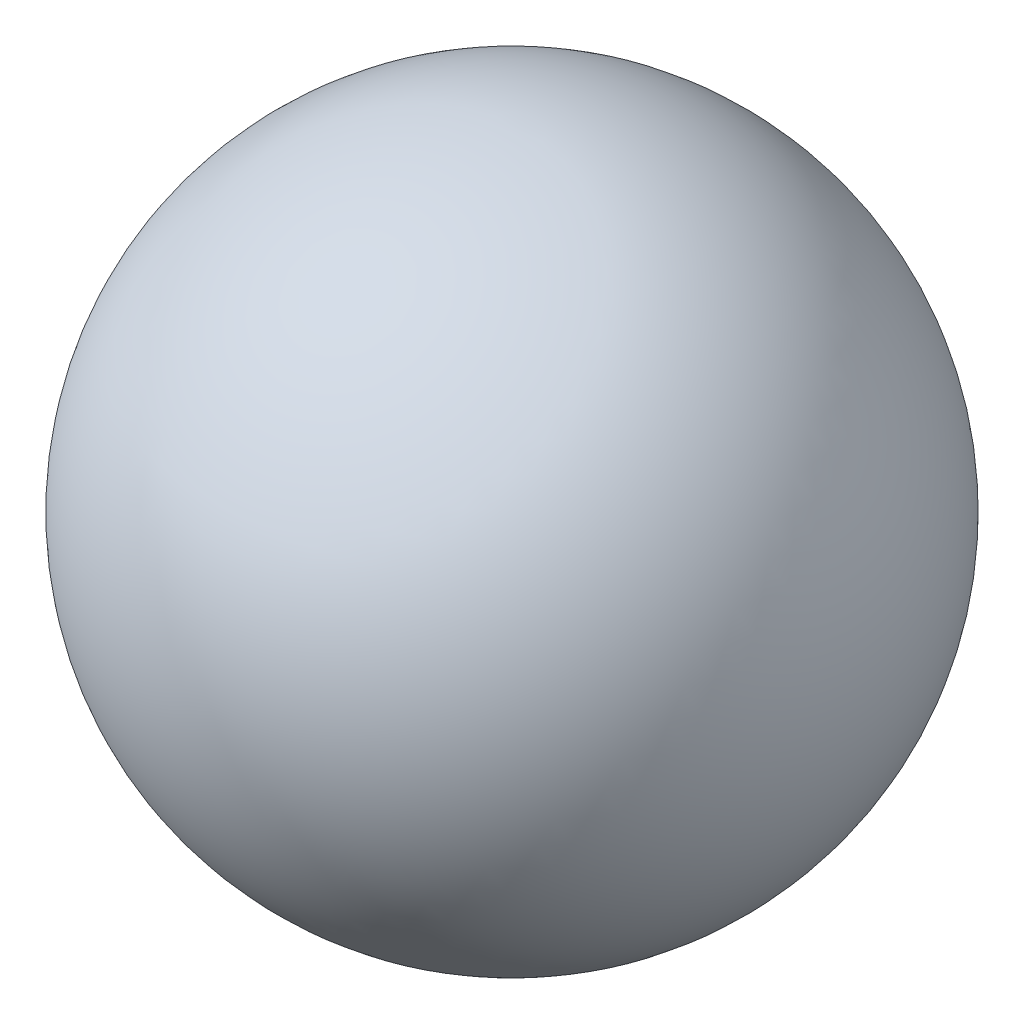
from build123d import *


with BuildPart() as part:
    # Skizze1 → Rotation1 (revolve)
    with BuildSketch(Plane.XY):
        with BuildLine():
            Line((0, -60), (0, 60))
            ThreePointArc((0, 60), (-60, 0), (0, -60))
        make_face()
    revolve(axis=Axis((0, -60, 0), (0, 1, 0)))


solid = part.part
